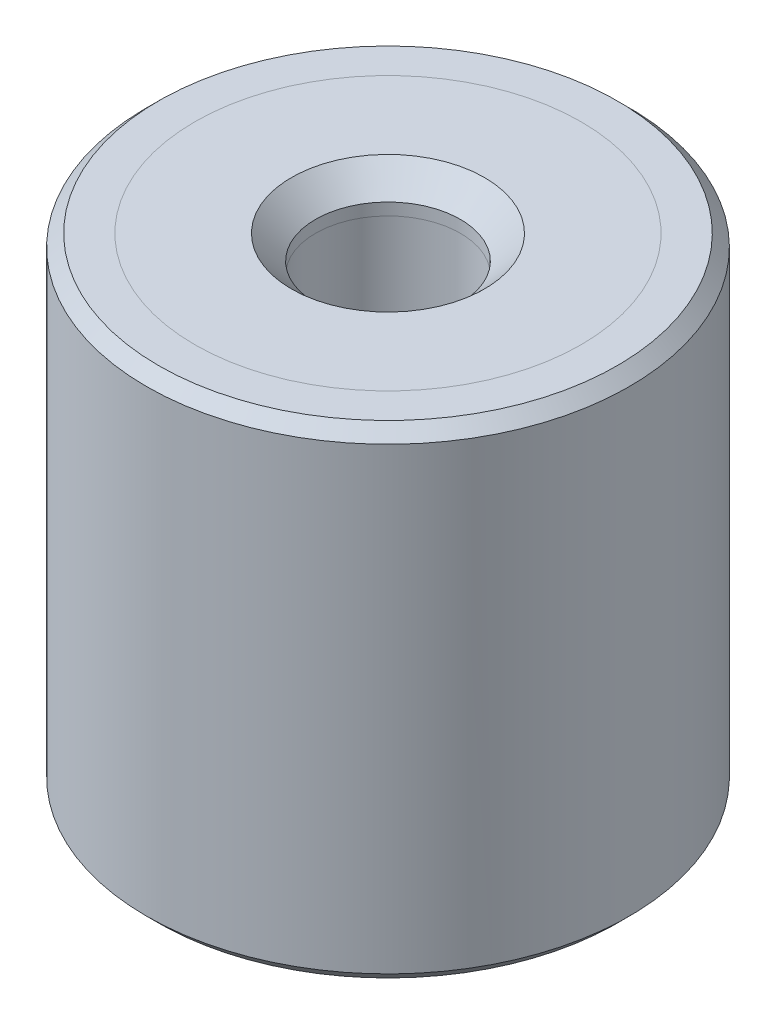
ISO-10303-21;
HEADER;
FILE_DESCRIPTION(('STEP AP214'),'2;1');
FILE_NAME('part.step','',(''),(''),'','','');
FILE_SCHEMA(('AUTOMOTIVE_DESIGN { 1 0 10303 214 1 1 1 1 }'));
ENDSEC;
DATA;
#1=APPLICATION_CONTEXT('core data for automotive mechanical design processes');
#2=APPLICATION_PROTOCOL_DEFINITION('international standard','automotive_design',2000,#1);
#3=PRODUCT_CONTEXT('',#1,'mechanical');
#4=PRODUCT('Part','Part','',(#3));
#5=PRODUCT_RELATED_PRODUCT_CATEGORY('part','',(#4));
#6=PRODUCT_DEFINITION_FORMATION('','',#4);
#7=PRODUCT_DEFINITION_CONTEXT('part definition',#1,'design');
#8=PRODUCT_DEFINITION('design','',#6,#7);
#9=PRODUCT_DEFINITION_SHAPE('','',#8);
#10=(LENGTH_UNIT() NAMED_UNIT(*) SI_UNIT(.MILLI.,.METRE.));
#11=(NAMED_UNIT(*) PLANE_ANGLE_UNIT() SI_UNIT($,.RADIAN.));
#12=(NAMED_UNIT(*) SI_UNIT($,.STERADIAN.) SOLID_ANGLE_UNIT());
#13=UNCERTAINTY_MEASURE_WITH_UNIT(LENGTH_MEASURE(1.E-05),#10,'distance_accuracy_value','');
#14=(GEOMETRIC_REPRESENTATION_CONTEXT(3) GLOBAL_UNCERTAINTY_ASSIGNED_CONTEXT((#13)) GLOBAL_UNIT_ASSIGNED_CONTEXT((#10,
#11,#12)) REPRESENTATION_CONTEXT('',''));
#15=CARTESIAN_POINT('',(0.,0.,0.));
#16=DIRECTION('',(0.,0.,1.));
#17=DIRECTION('',(1.,0.,0.));
#18=AXIS2_PLACEMENT_3D('',#15,#16,#17);
#19=CARTESIAN_POINT('',(0.,51.0340428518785,0.));
#20=DIRECTION('',(0.,1.,0.));
#21=DIRECTION('',(0.,0.,1.));
#22=AXIS2_PLACEMENT_3D('',#19,#20,#21);
#23=CYLINDRICAL_SURFACE('',#22,3.);
#24=CARTESIAN_POINT('',(0.,-17.5,0.));
#25=DIRECTION('',(0.,-1.,0.));
#26=DIRECTION('',(0.,0.,-1.));
#27=AXIS2_PLACEMENT_3D('',#24,#25,#26);
#28=CIRCLE('',#27,3.);
#29=CARTESIAN_POINT('',(0.,-17.5,-3.));
#30=VERTEX_POINT('',#29);
#31=EDGE_CURVE('P0_E10',#30,#30,#28,.T.);
#32=ORIENTED_EDGE('',*,*,#31,.T.);
#33=EDGE_LOOP('',(#32));
#34=FACE_BOUND('',#33,.T.);
#35=CARTESIAN_POINT('',(0.,-17.,0.));
#36=DIRECTION('',(0.,1.,0.));
#37=DIRECTION('',(0.,0.,1.));
#38=AXIS2_PLACEMENT_3D('',#35,#36,#37);
#39=CIRCLE('',#38,3.);
#40=CARTESIAN_POINT('',(0.,-17.,3.));
#41=VERTEX_POINT('',#40);
#42=EDGE_CURVE('P0_E25',#41,#41,#39,.T.);
#43=ORIENTED_EDGE('',*,*,#42,.T.);
#44=EDGE_LOOP('',(#43));
#45=FACE_BOUND('',#44,.T.);
#46=ADVANCED_FACE('P0_F14',(#34,#45),#23,.F.);
#47=CARTESIAN_POINT('',(0.,-17.,3.));
#48=DIRECTION('',(0.,1.,0.));
#49=DIRECTION('',(0.,0.,1.));
#50=AXIS2_PLACEMENT_3D('',#47,#48,#49);
#51=PLANE('',#50);
#52=CARTESIAN_POINT('',(0.,-17.,0.));
#53=DIRECTION('',(0.,1.,0.));
#54=DIRECTION('',(0.,0.,1.));
#55=AXIS2_PLACEMENT_3D('',#52,#53,#54);
#56=CIRCLE('',#55,8.);
#57=CARTESIAN_POINT('',(0.,-17.,8.));
#58=VERTEX_POINT('',#57);
#59=EDGE_CURVE('P0_E29',#58,#58,#56,.T.);
#60=ORIENTED_EDGE('',*,*,#59,.T.);
#61=EDGE_LOOP('',(#60));
#62=FACE_BOUND('',#61,.T.);
#63=ORIENTED_EDGE('',*,*,#42,.F.);
#64=EDGE_LOOP('',(#63));
#65=FACE_BOUND('',#64,.T.);
#66=ADVANCED_FACE('P0_F50',(#62,#65),#51,.T.);
#67=CARTESIAN_POINT('',(0.,51.0340428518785,0.));
#68=DIRECTION('',(0.,1.,0.));
#69=DIRECTION('',(0.,0.,1.));
#70=AXIS2_PLACEMENT_3D('',#67,#68,#69);
#71=CYLINDRICAL_SURFACE('',#70,8.);
#72=CARTESIAN_POINT('',(0.,-18.5,0.));
#73=DIRECTION('',(0.,1.,0.));
#74=DIRECTION('',(0.,0.,1.));
#75=AXIS2_PLACEMENT_3D('',#72,#73,#74);
#76=CIRCLE('',#75,8.);
#77=CARTESIAN_POINT('',(0.,-18.5,8.));
#78=VERTEX_POINT('',#77);
#79=EDGE_CURVE('P0_E34',#78,#78,#76,.T.);
#80=ORIENTED_EDGE('',*,*,#79,.T.);
#81=EDGE_LOOP('',(#80));
#82=FACE_BOUND('',#81,.T.);
#83=ORIENTED_EDGE('',*,*,#59,.F.);
#84=EDGE_LOOP('',(#83));
#85=FACE_BOUND('',#84,.T.);
#86=ADVANCED_FACE('P0_F38',(#82,#85),#71,.T.);
#87=CARTESIAN_POINT('',(0.,-18.5,8.));
#88=DIRECTION('',(0.,-1.,0.));
#89=DIRECTION('',(0.,0.,-1.));
#90=AXIS2_PLACEMENT_3D('',#87,#88,#89);
#91=PLANE('',#90);
#92=CARTESIAN_POINT('',(0.,-18.5,0.));
#93=DIRECTION('',(0.,-1.,0.));
#94=DIRECTION('',(0.,0.,-1.));
#95=AXIS2_PLACEMENT_3D('',#92,#93,#94);
#96=CIRCLE('',#95,4.);
#97=CARTESIAN_POINT('',(0.,-18.5,-4.));
#98=VERTEX_POINT('',#97);
#99=EDGE_CURVE('P0_E21',#98,#98,#96,.F.);
#100=ORIENTED_EDGE('',*,*,#99,.T.);
#101=EDGE_LOOP('',(#100));
#102=FACE_BOUND('',#101,.T.);
#103=ORIENTED_EDGE('',*,*,#79,.F.);
#104=EDGE_LOOP('',(#103));
#105=FACE_BOUND('',#104,.T.);
#106=ADVANCED_FACE('P0_F41',(#102,#105),#91,.T.);
#107=CARTESIAN_POINT('',(0.,-18.5,0.));
#108=DIRECTION('',(0.,-1.,0.));
#109=DIRECTION('',(0.,0.,-1.));
#110=AXIS2_PLACEMENT_3D('',#107,#108,#109);
#111=CONICAL_SURFACE('',#110,4.,0.785398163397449);
#112=ORIENTED_EDGE('',*,*,#31,.F.);
#113=EDGE_LOOP('',(#112));
#114=FACE_BOUND('',#113,.T.);
#115=ORIENTED_EDGE('',*,*,#99,.F.);
#116=EDGE_LOOP('',(#115));
#117=FACE_BOUND('',#116,.T.);
#118=ADVANCED_FACE('P0_F16',(#114,#117),#111,.F.);
#119=CLOSED_SHELL('',(#46,#66,#86,#106,#118));
#120=MANIFOLD_SOLID_BREP('P0_B1',#119);
#121=CARTESIAN_POINT('',(0.,69.5340428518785,0.));
#122=DIRECTION('',(0.,1.,0.));
#123=DIRECTION('',(0.,0.,1.));
#124=AXIS2_PLACEMENT_3D('',#121,#122,#123);
#125=CYLINDRICAL_SURFACE('',#124,3.);
#126=CARTESIAN_POINT('',(0.,0.5,0.));
#127=DIRECTION('',(0.,1.,0.));
#128=DIRECTION('',(0.,0.,1.));
#129=AXIS2_PLACEMENT_3D('',#126,#127,#128);
#130=CIRCLE('',#129,3.);
#131=CARTESIAN_POINT('',(0.,0.5,3.));
#132=VERTEX_POINT('',#131);
#133=EDGE_CURVE('P1_E21',#132,#132,#130,.T.);
#134=ORIENTED_EDGE('',*,*,#133,.T.);
#135=EDGE_LOOP('',(#134));
#136=FACE_BOUND('',#135,.T.);
#137=CARTESIAN_POINT('',(0.,0.,0.));
#138=DIRECTION('',(0.,1.,0.));
#139=DIRECTION('',(0.,0.,1.));
#140=AXIS2_PLACEMENT_3D('',#137,#138,#139);
#141=CIRCLE('',#140,3.);
#142=CARTESIAN_POINT('',(0.,0.,3.));
#143=VERTEX_POINT('',#142);
#144=EDGE_CURVE('P1_E34',#143,#143,#141,.T.);
#145=ORIENTED_EDGE('',*,*,#144,.F.);
#146=EDGE_LOOP('',(#145));
#147=FACE_BOUND('',#146,.T.);
#148=ADVANCED_FACE('P1_F14',(#136,#147),#125,.F.);
#149=CARTESIAN_POINT('',(0.,1.5,3.));
#150=DIRECTION('',(0.,1.,0.));
#151=DIRECTION('',(0.,0.,1.));
#152=AXIS2_PLACEMENT_3D('',#149,#150,#151);
#153=PLANE('',#152);
#154=CARTESIAN_POINT('',(0.,1.5,0.));
#155=DIRECTION('',(0.,1.,0.));
#156=DIRECTION('',(0.,0.,1.));
#157=AXIS2_PLACEMENT_3D('',#154,#155,#156);
#158=CIRCLE('',#157,4.);
#159=CARTESIAN_POINT('',(0.,1.5,4.));
#160=VERTEX_POINT('',#159);
#161=EDGE_CURVE('P1_E10',#160,#160,#158,.F.);
#162=ORIENTED_EDGE('',*,*,#161,.T.);
#163=EDGE_LOOP('',(#162));
#164=FACE_BOUND('',#163,.T.);
#165=CARTESIAN_POINT('',(0.,1.5,0.));
#166=DIRECTION('',(0.,1.,0.));
#167=DIRECTION('',(0.,0.,1.));
#168=AXIS2_PLACEMENT_3D('',#165,#166,#167);
#169=CIRCLE('',#168,8.);
#170=CARTESIAN_POINT('',(0.,1.5,8.));
#171=VERTEX_POINT('',#170);
#172=EDGE_CURVE('P1_E25',#171,#171,#169,.T.);
#173=ORIENTED_EDGE('',*,*,#172,.T.);
#174=EDGE_LOOP('',(#173));
#175=FACE_BOUND('',#174,.T.);
#176=ADVANCED_FACE('P1_F42',(#164,#175),#153,.T.);
#177=CARTESIAN_POINT('',(0.,69.5340428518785,0.));
#178=DIRECTION('',(0.,1.,0.));
#179=DIRECTION('',(0.,0.,1.));
#180=AXIS2_PLACEMENT_3D('',#177,#178,#179);
#181=CYLINDRICAL_SURFACE('',#180,8.);
#182=CARTESIAN_POINT('',(0.,0.,0.));
#183=DIRECTION('',(0.,1.,0.));
#184=DIRECTION('',(0.,0.,1.));
#185=AXIS2_PLACEMENT_3D('',#182,#183,#184);
#186=CIRCLE('',#185,8.);
#187=CARTESIAN_POINT('',(0.,0.,8.));
#188=VERTEX_POINT('',#187);
#189=EDGE_CURVE('P1_E29',#188,#188,#186,.T.);
#190=ORIENTED_EDGE('',*,*,#189,.T.);
#191=EDGE_LOOP('',(#190));
#192=FACE_BOUND('',#191,.T.);
#193=ORIENTED_EDGE('',*,*,#172,.F.);
#194=EDGE_LOOP('',(#193));
#195=FACE_BOUND('',#194,.T.);
#196=ADVANCED_FACE('P1_F47',(#192,#195),#181,.T.);
#197=CARTESIAN_POINT('',(0.,0.,8.));
#198=DIRECTION('',(0.,-1.,0.));
#199=DIRECTION('',(0.,0.,-1.));
#200=AXIS2_PLACEMENT_3D('',#197,#198,#199);
#201=PLANE('',#200);
#202=ORIENTED_EDGE('',*,*,#144,.T.);
#203=EDGE_LOOP('',(#202));
#204=FACE_BOUND('',#203,.T.);
#205=ORIENTED_EDGE('',*,*,#189,.F.);
#206=EDGE_LOOP('',(#205));
#207=FACE_BOUND('',#206,.T.);
#208=ADVANCED_FACE('P1_F38',(#204,#207),#201,.T.);
#209=CARTESIAN_POINT('',(0.,0.5,0.));
#210=DIRECTION('',(0.,1.,0.));
#211=DIRECTION('',(0.,0.,1.));
#212=AXIS2_PLACEMENT_3D('',#209,#210,#211);
#213=CONICAL_SURFACE('',#212,3.,0.78539816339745);
#214=ORIENTED_EDGE('',*,*,#161,.F.);
#215=EDGE_LOOP('',(#214));
#216=FACE_BOUND('',#215,.T.);
#217=ORIENTED_EDGE('',*,*,#133,.F.);
#218=EDGE_LOOP('',(#217));
#219=FACE_BOUND('',#218,.T.);
#220=ADVANCED_FACE('P1_F16',(#216,#219),#213,.F.);
#221=CLOSED_SHELL('',(#148,#176,#196,#208,#220));
#222=MANIFOLD_SOLID_BREP('P1_B1',#221);
#223=CARTESIAN_POINT('',(0.,0.,0.));
#224=DIRECTION('',(0.,1.,0.));
#225=DIRECTION('',(0.,0.,1.));
#226=AXIS2_PLACEMENT_3D('',#223,#224,#225);
#227=PLANE('',#226);
#228=CARTESIAN_POINT('',(0.,0.,0.));
#229=DIRECTION('',(0.,1.,0.));
#230=DIRECTION('',(0.,0.,1.));
#231=AXIS2_PLACEMENT_3D('',#228,#229,#230);
#232=CIRCLE('',#231,3.);
#233=CARTESIAN_POINT('',(0.,0.,3.));
#234=VERTEX_POINT('',#233);
#235=EDGE_CURVE('P2_E46',#234,#234,#232,.T.);
#236=ORIENTED_EDGE('',*,*,#235,.F.);
#237=EDGE_LOOP('',(#236));
#238=FACE_BOUND('',#237,.T.);
#239=CARTESIAN_POINT('',(0.,0.,0.));
#240=DIRECTION('',(0.,1.,0.));
#241=DIRECTION('',(0.,0.,1.));
#242=AXIS2_PLACEMENT_3D('',#239,#240,#241);
#243=CIRCLE('',#242,8.);
#244=CARTESIAN_POINT('',(0.,0.,8.));
#245=VERTEX_POINT('',#244);
#246=EDGE_CURVE('P2_E33',#245,#245,#243,.T.);
#247=ORIENTED_EDGE('',*,*,#246,.T.);
#248=EDGE_LOOP('',(#247));
#249=FACE_BOUND('',#248,.T.);
#250=ADVANCED_FACE('P2_F13',(#238,#249),#227,.T.);
#251=CARTESIAN_POINT('',(0.,65.5134936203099,0.));
#252=DIRECTION('',(0.,1.,0.));
#253=DIRECTION('',(0.,0.,1.));
#254=AXIS2_PLACEMENT_3D('',#251,#252,#253);
#255=CYLINDRICAL_SURFACE('',#254,8.);
#256=CARTESIAN_POINT('',(0.,1.5,0.));
#257=DIRECTION('',(0.,1.,0.));
#258=DIRECTION('',(0.,0.,1.));
#259=AXIS2_PLACEMENT_3D('',#256,#257,#258);
#260=CIRCLE('',#259,8.);
#261=CARTESIAN_POINT('',(0.,1.5,8.));
#262=VERTEX_POINT('',#261);
#263=EDGE_CURVE('P2_E36',#262,#262,#260,.T.);
#264=ORIENTED_EDGE('',*,*,#263,.T.);
#265=EDGE_LOOP('',(#264));
#266=FACE_BOUND('',#265,.T.);
#267=ORIENTED_EDGE('',*,*,#246,.F.);
#268=EDGE_LOOP('',(#267));
#269=FACE_BOUND('',#268,.T.);
#270=ADVANCED_FACE('P2_F92',(#266,#269),#255,.F.);
#271=CARTESIAN_POINT('',(0.,1.5,8.));
#272=DIRECTION('',(0.,1.,0.));
#273=DIRECTION('',(0.,0.,1.));
#274=AXIS2_PLACEMENT_3D('',#271,#272,#273);
#275=PLANE('',#274);
#276=CARTESIAN_POINT('',(0.,1.5,0.));
#277=DIRECTION('',(0.,1.,0.));
#278=DIRECTION('',(0.,0.,1.));
#279=AXIS2_PLACEMENT_3D('',#276,#277,#278);
#280=CIRCLE('',#279,9.50000000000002);
#281=CARTESIAN_POINT('',(0.,1.5,9.50000000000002));
#282=VERTEX_POINT('',#281);
#283=EDGE_CURVE('P2_E9',#282,#282,#280,.T.);
#284=ORIENTED_EDGE('',*,*,#283,.T.);
#285=EDGE_LOOP('',(#284));
#286=FACE_BOUND('',#285,.T.);
#287=ORIENTED_EDGE('',*,*,#263,.F.);
#288=EDGE_LOOP('',(#287));
#289=FACE_BOUND('',#288,.T.);
#290=ADVANCED_FACE('P2_F88',(#286,#289),#275,.T.);
#291=CARTESIAN_POINT('',(0.,65.5134936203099,0.));
#292=DIRECTION('',(0.,1.,0.));
#293=DIRECTION('',(0.,0.,1.));
#294=AXIS2_PLACEMENT_3D('',#291,#292,#293);
#295=CYLINDRICAL_SURFACE('',#294,10.);
#296=CARTESIAN_POINT('',(0.,-18.,0.));
#297=DIRECTION('',(0.,-1.,0.));
#298=DIRECTION('',(0.,0.,-1.));
#299=AXIS2_PLACEMENT_3D('',#296,#297,#298);
#300=CIRCLE('',#299,10.);
#301=CARTESIAN_POINT('',(0.,-18.,-10.));
#302=VERTEX_POINT('',#301);
#303=EDGE_CURVE('P2_E24',#302,#302,#300,.F.);
#304=ORIENTED_EDGE('',*,*,#303,.T.);
#305=EDGE_LOOP('',(#304));
#306=FACE_BOUND('',#305,.T.);
#307=CARTESIAN_POINT('',(0.,1.00000000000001,0.));
#308=DIRECTION('',(0.,1.,0.));
#309=DIRECTION('',(0.,0.,1.));
#310=AXIS2_PLACEMENT_3D('',#307,#308,#309);
#311=CIRCLE('',#310,10.);
#312=CARTESIAN_POINT('',(0.,1.00000000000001,10.));
#313=VERTEX_POINT('',#312);
#314=EDGE_CURVE('P2_E28',#313,#313,#311,.F.);
#315=ORIENTED_EDGE('',*,*,#314,.T.);
#316=EDGE_LOOP('',(#315));
#317=FACE_BOUND('',#316,.T.);
#318=ADVANCED_FACE('P2_F82',(#306,#317),#295,.T.);
#319=CARTESIAN_POINT('',(0.,-18.5,10.));
#320=DIRECTION('',(0.,-1.,0.));
#321=DIRECTION('',(0.,0.,-1.));
#322=AXIS2_PLACEMENT_3D('',#319,#320,#321);
#323=PLANE('',#322);
#324=CARTESIAN_POINT('',(0.,-18.5,0.));
#325=DIRECTION('',(0.,-1.,0.));
#326=DIRECTION('',(0.,0.,-1.));
#327=AXIS2_PLACEMENT_3D('',#324,#325,#326);
#328=CIRCLE('',#327,9.5);
#329=CARTESIAN_POINT('',(0.,-18.5,-9.5));
#330=VERTEX_POINT('',#329);
#331=EDGE_CURVE('P2_E20',#330,#330,#328,.T.);
#332=ORIENTED_EDGE('',*,*,#331,.T.);
#333=EDGE_LOOP('',(#332));
#334=FACE_BOUND('',#333,.T.);
#335=CARTESIAN_POINT('',(0.,-18.5,0.));
#336=DIRECTION('',(0.,1.,0.));
#337=DIRECTION('',(0.,0.,1.));
#338=AXIS2_PLACEMENT_3D('',#335,#336,#337);
#339=CIRCLE('',#338,8.);
#340=CARTESIAN_POINT('',(0.,-18.5,8.));
#341=VERTEX_POINT('',#340);
#342=EDGE_CURVE('P2_E39',#341,#341,#339,.T.);
#343=ORIENTED_EDGE('',*,*,#342,.T.);
#344=EDGE_LOOP('',(#343));
#345=FACE_BOUND('',#344,.T.);
#346=ADVANCED_FACE('P2_F77',(#334,#345),#323,.T.);
#347=CARTESIAN_POINT('',(0.,65.5134936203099,0.));
#348=DIRECTION('',(0.,1.,0.));
#349=DIRECTION('',(0.,0.,1.));
#350=AXIS2_PLACEMENT_3D('',#347,#348,#349);
#351=CYLINDRICAL_SURFACE('',#350,8.);
#352=CARTESIAN_POINT('',(0.,-17.,0.));
#353=DIRECTION('',(0.,1.,0.));
#354=DIRECTION('',(0.,0.,1.));
#355=AXIS2_PLACEMENT_3D('',#352,#353,#354);
#356=CIRCLE('',#355,8.);
#357=CARTESIAN_POINT('',(0.,-17.,8.));
#358=VERTEX_POINT('',#357);
#359=EDGE_CURVE('P2_E42',#358,#358,#356,.T.);
#360=ORIENTED_EDGE('',*,*,#359,.T.);
#361=EDGE_LOOP('',(#360));
#362=FACE_BOUND('',#361,.T.);
#363=ORIENTED_EDGE('',*,*,#342,.F.);
#364=EDGE_LOOP('',(#363));
#365=FACE_BOUND('',#364,.T.);
#366=ADVANCED_FACE('P2_F71',(#362,#365),#351,.F.);
#367=CARTESIAN_POINT('',(0.,-17.,8.));
#368=DIRECTION('',(0.,-1.,0.));
#369=DIRECTION('',(0.,0.,-1.));
#370=AXIS2_PLACEMENT_3D('',#367,#368,#369);
#371=PLANE('',#370);
#372=CARTESIAN_POINT('',(0.,-17.,0.));
#373=DIRECTION('',(0.,-1.,0.));
#374=DIRECTION('',(0.,0.,-1.));
#375=AXIS2_PLACEMENT_3D('',#372,#373,#374);
#376=CIRCLE('',#375,3.);
#377=CARTESIAN_POINT('',(0.,-17.,-3.));
#378=VERTEX_POINT('',#377);
#379=EDGE_CURVE('P2_E52',#378,#378,#376,.T.);
#380=ORIENTED_EDGE('',*,*,#379,.F.);
#381=EDGE_LOOP('',(#380));
#382=FACE_BOUND('',#381,.T.);
#383=ORIENTED_EDGE('',*,*,#359,.F.);
#384=EDGE_LOOP('',(#383));
#385=FACE_BOUND('',#384,.T.);
#386=ADVANCED_FACE('P2_F67',(#382,#385),#371,.T.);
#387=CARTESIAN_POINT('',(0.,-18.,0.));
#388=DIRECTION('',(0.,1.,0.));
#389=DIRECTION('',(0.,0.,1.));
#390=AXIS2_PLACEMENT_3D('',#387,#388,#389);
#391=CONICAL_SURFACE('',#390,10.,0.785398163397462);
#392=ORIENTED_EDGE('',*,*,#331,.F.);
#393=EDGE_LOOP('',(#392));
#394=FACE_BOUND('',#393,.T.);
#395=ORIENTED_EDGE('',*,*,#303,.F.);
#396=EDGE_LOOP('',(#395));
#397=FACE_BOUND('',#396,.T.);
#398=ADVANCED_FACE('P2_F70',(#394,#397),#391,.T.);
#399=CARTESIAN_POINT('',(0.,1.5,0.));
#400=DIRECTION('',(0.,-1.,0.));
#401=DIRECTION('',(0.,0.,-1.));
#402=AXIS2_PLACEMENT_3D('',#399,#400,#401);
#403=CONICAL_SURFACE('',#402,9.50000000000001,0.785398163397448);
#404=ORIENTED_EDGE('',*,*,#314,.F.);
#405=EDGE_LOOP('',(#404));
#406=FACE_BOUND('',#405,.T.);
#407=ORIENTED_EDGE('',*,*,#283,.F.);
#408=EDGE_LOOP('',(#407));
#409=FACE_BOUND('',#408,.T.);
#410=ADVANCED_FACE('P2_F15',(#406,#409),#403,.T.);
#411=CARTESIAN_POINT('',(0.,-4.5,0.));
#412=DIRECTION('',(0.,1.,0.));
#413=DIRECTION('',(0.,0.,1.));
#414=AXIS2_PLACEMENT_3D('',#411,#412,#413);
#415=CYLINDRICAL_SURFACE('',#414,3.);
#416=CARTESIAN_POINT('',(0.,-4.5,0.));
#417=DIRECTION('',(0.,1.,0.));
#418=DIRECTION('',(0.,0.,1.));
#419=AXIS2_PLACEMENT_3D('',#416,#417,#418);
#420=CIRCLE('',#419,3.);
#421=CARTESIAN_POINT('',(0.,-4.5,3.));
#422=VERTEX_POINT('',#421);
#423=EDGE_CURVE('P2_E45',#422,#422,#420,.T.);
#424=ORIENTED_EDGE('',*,*,#423,.F.);
#425=EDGE_LOOP('',(#424));
#426=FACE_BOUND('',#425,.T.);
#427=ORIENTED_EDGE('',*,*,#235,.T.);
#428=EDGE_LOOP('',(#427));
#429=FACE_BOUND('',#428,.T.);
#430=ADVANCED_FACE('P2_F108',(#426,#429),#415,.F.);
#431=CARTESIAN_POINT('',(0.,-4.5,0.));
#432=DIRECTION('',(0.,1.,0.));
#433=DIRECTION('',(0.,0.,1.));
#434=AXIS2_PLACEMENT_3D('',#431,#432,#433);
#435=PLANE('',#434);
#436=ORIENTED_EDGE('',*,*,#423,.T.);
#437=EDGE_LOOP('',(#436));
#438=FACE_BOUND('',#437,.T.);
#439=ADVANCED_FACE('P2_F63',(#438),#435,.T.);
#440=CARTESIAN_POINT('',(0.,-12.5,0.));
#441=DIRECTION('',(0.,-1.,0.));
#442=DIRECTION('',(0.,0.,-1.));
#443=AXIS2_PLACEMENT_3D('',#440,#441,#442);
#444=CYLINDRICAL_SURFACE('',#443,3.);
#445=CARTESIAN_POINT('',(0.,-12.5,0.));
#446=DIRECTION('',(0.,-1.,0.));
#447=DIRECTION('',(0.,0.,-1.));
#448=AXIS2_PLACEMENT_3D('',#445,#446,#447);
#449=CIRCLE('',#448,3.);
#450=CARTESIAN_POINT('',(0.,-12.5,-3.));
#451=VERTEX_POINT('',#450);
#452=EDGE_CURVE('P2_E49',#451,#451,#449,.T.);
#453=ORIENTED_EDGE('',*,*,#452,.F.);
#454=EDGE_LOOP('',(#453));
#455=FACE_BOUND('',#454,.T.);
#456=ORIENTED_EDGE('',*,*,#379,.T.);
#457=EDGE_LOOP('',(#456));
#458=FACE_BOUND('',#457,.T.);
#459=ADVANCED_FACE('P2_F60',(#455,#458),#444,.F.);
#460=CARTESIAN_POINT('',(0.,-12.5,0.));
#461=DIRECTION('',(0.,-1.,0.));
#462=DIRECTION('',(0.,0.,-1.));
#463=AXIS2_PLACEMENT_3D('',#460,#461,#462);
#464=PLANE('',#463);
#465=ORIENTED_EDGE('',*,*,#452,.T.);
#466=EDGE_LOOP('',(#465));
#467=FACE_BOUND('',#466,.T.);
#468=ADVANCED_FACE('P2_F58',(#467),#464,.T.);
#469=CLOSED_SHELL('',(#250,#270,#290,#318,#346,#366,#386,#398,#410,#430,#439,#459,#468));
#470=MANIFOLD_SOLID_BREP('P2_B1',#469);
#471=ADVANCED_BREP_SHAPE_REPRESENTATION('',(#18,#120,#222,#470),#14);
#472=SHAPE_DEFINITION_REPRESENTATION(#9,#471);
ENDSEC;
END-ISO-10303-21;
